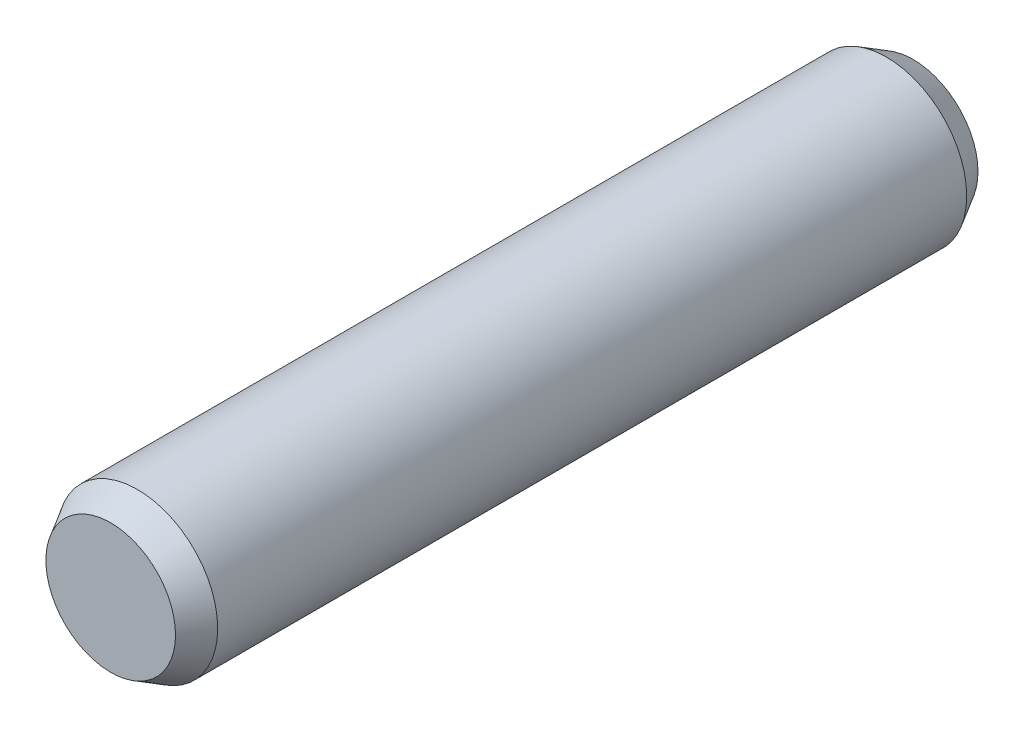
ISO-10303-21;
HEADER;
FILE_DESCRIPTION(('STEP AP214'),'2;1');
FILE_NAME('part.step','',(''),(''),'','','');
FILE_SCHEMA(('AUTOMOTIVE_DESIGN { 1 0 10303 214 1 1 1 1 }'));
ENDSEC;
DATA;
#1=APPLICATION_CONTEXT('core data for automotive mechanical design processes');
#2=APPLICATION_PROTOCOL_DEFINITION('international standard','automotive_design',2000,#1);
#3=PRODUCT_CONTEXT('',#1,'mechanical');
#4=PRODUCT('Part','Part','',(#3));
#5=PRODUCT_RELATED_PRODUCT_CATEGORY('part','',(#4));
#6=PRODUCT_DEFINITION_FORMATION('','',#4);
#7=PRODUCT_DEFINITION_CONTEXT('part definition',#1,'design');
#8=PRODUCT_DEFINITION('design','',#6,#7);
#9=PRODUCT_DEFINITION_SHAPE('','',#8);
#10=(LENGTH_UNIT() NAMED_UNIT(*) SI_UNIT(.MILLI.,.METRE.));
#11=(NAMED_UNIT(*) PLANE_ANGLE_UNIT() SI_UNIT($,.RADIAN.));
#12=(NAMED_UNIT(*) SI_UNIT($,.STERADIAN.) SOLID_ANGLE_UNIT());
#13=UNCERTAINTY_MEASURE_WITH_UNIT(LENGTH_MEASURE(1.E-05),#10,'distance_accuracy_value','');
#14=(GEOMETRIC_REPRESENTATION_CONTEXT(3) GLOBAL_UNCERTAINTY_ASSIGNED_CONTEXT((#13)) GLOBAL_UNIT_ASSIGNED_CONTEXT((#10,
#11,#12)) REPRESENTATION_CONTEXT('',''));
#15=CARTESIAN_POINT('',(0.,0.,0.));
#16=DIRECTION('',(0.,0.,1.));
#17=DIRECTION('',(1.,0.,0.));
#18=AXIS2_PLACEMENT_3D('',#15,#16,#17);
#19=CARTESIAN_POINT('',(0.,0.,15.));
#20=DIRECTION('',(0.,0.,-1.));
#21=DIRECTION('',(-1.,0.,0.));
#22=AXIS2_PLACEMENT_3D('',#19,#20,#21);
#23=CYLINDRICAL_SURFACE('',#22,3.);
#24=CARTESIAN_POINT('',(0.,0.,-14.));
#25=DIRECTION('',(0.,0.,1.));
#26=DIRECTION('',(1.,0.,0.));
#27=AXIS2_PLACEMENT_3D('',#24,#25,#26);
#28=CIRCLE('',#27,3.);
#29=CARTESIAN_POINT('',(3.,0.,-14.));
#30=VERTEX_POINT('',#29);
#31=EDGE_CURVE('E39',#30,#30,#28,.T.);
#32=ORIENTED_EDGE('',*,*,#31,.T.);
#33=EDGE_LOOP('',(#32));
#34=FACE_BOUND('',#33,.T.);
#35=CARTESIAN_POINT('',(0.,0.,14.));
#36=DIRECTION('',(0.,0.,1.));
#37=DIRECTION('',(1.,0.,0.));
#38=AXIS2_PLACEMENT_3D('',#35,#36,#37);
#39=CIRCLE('',#38,3.);
#40=CARTESIAN_POINT('',(3.,0.,14.));
#41=VERTEX_POINT('',#40);
#42=EDGE_CURVE('E43',#41,#41,#39,.F.);
#43=ORIENTED_EDGE('',*,*,#42,.T.);
#44=EDGE_LOOP('',(#43));
#45=FACE_BOUND('',#44,.T.);
#46=ADVANCED_FACE('F29',(#34,#45),#23,.T.);
#47=CARTESIAN_POINT('',(0.,0.,15.));
#48=DIRECTION('',(0.,0.,1.));
#49=DIRECTION('',(1.,0.,0.));
#50=AXIS2_PLACEMENT_3D('',#47,#48,#49);
#51=PLANE('',#50);
#52=CARTESIAN_POINT('',(0.,0.,15.));
#53=DIRECTION('',(0.,0.,1.));
#54=DIRECTION('',(1.,0.,0.));
#55=AXIS2_PLACEMENT_3D('',#52,#53,#54);
#56=CIRCLE('',#55,2.42264973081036);
#57=CARTESIAN_POINT('',(2.42264973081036,0.,15.));
#58=VERTEX_POINT('',#57);
#59=EDGE_CURVE('E10',#58,#58,#56,.T.);
#60=ORIENTED_EDGE('',*,*,#59,.T.);
#61=EDGE_LOOP('',(#60));
#62=FACE_BOUND('',#61,.T.);
#63=ADVANCED_FACE('F62',(#62),#51,.T.);
#64=CARTESIAN_POINT('',(0.,0.,-15.));
#65=DIRECTION('',(0.,0.,1.));
#66=DIRECTION('',(1.,0.,0.));
#67=AXIS2_PLACEMENT_3D('',#64,#65,#66);
#68=PLANE('',#67);
#69=CARTESIAN_POINT('',(0.,0.,-15.));
#70=DIRECTION('',(0.,0.,1.));
#71=DIRECTION('',(1.,0.,0.));
#72=AXIS2_PLACEMENT_3D('',#69,#70,#71);
#73=CIRCLE('',#72,2.42264973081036);
#74=CARTESIAN_POINT('',(2.42264973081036,0.,-15.));
#75=VERTEX_POINT('',#74);
#76=EDGE_CURVE('E35',#75,#75,#73,.F.);
#77=ORIENTED_EDGE('',*,*,#76,.T.);
#78=EDGE_LOOP('',(#77));
#79=FACE_BOUND('',#78,.T.);
#80=ADVANCED_FACE('F58',(#79),#68,.F.);
#81=CARTESIAN_POINT('',(0.,0.,-14.));
#82=DIRECTION('',(0.,0.,1.));
#83=DIRECTION('',(1.,0.,0.));
#84=AXIS2_PLACEMENT_3D('',#81,#82,#83);
#85=CONICAL_SURFACE('',#84,3.,0.523598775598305);
#86=ORIENTED_EDGE('',*,*,#76,.F.);
#87=EDGE_LOOP('',(#86));
#88=FACE_BOUND('',#87,.T.);
#89=ORIENTED_EDGE('',*,*,#31,.F.);
#90=EDGE_LOOP('',(#89));
#91=FACE_BOUND('',#90,.T.);
#92=ADVANCED_FACE('F53',(#88,#91),#85,.T.);
#93=CARTESIAN_POINT('',(0.,0.,15.));
#94=DIRECTION('',(0.,0.,-1.));
#95=DIRECTION('',(-1.,0.,0.));
#96=AXIS2_PLACEMENT_3D('',#93,#94,#95);
#97=CONICAL_SURFACE('',#96,2.42264973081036,0.523598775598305);
#98=ORIENTED_EDGE('',*,*,#42,.F.);
#99=EDGE_LOOP('',(#98));
#100=FACE_BOUND('',#99,.T.);
#101=ORIENTED_EDGE('',*,*,#59,.F.);
#102=EDGE_LOOP('',(#101));
#103=FACE_BOUND('',#102,.T.);
#104=ADVANCED_FACE('F50',(#100,#103),#97,.T.);
#105=CLOSED_SHELL('',(#46,#63,#80,#92,#104));
#106=MANIFOLD_SOLID_BREP('B2',#105);
#107=ADVANCED_BREP_SHAPE_REPRESENTATION('',(#18,#106),#14);
#108=SHAPE_DEFINITION_REPRESENTATION(#9,#107);
ENDSEC;
END-ISO-10303-21;
